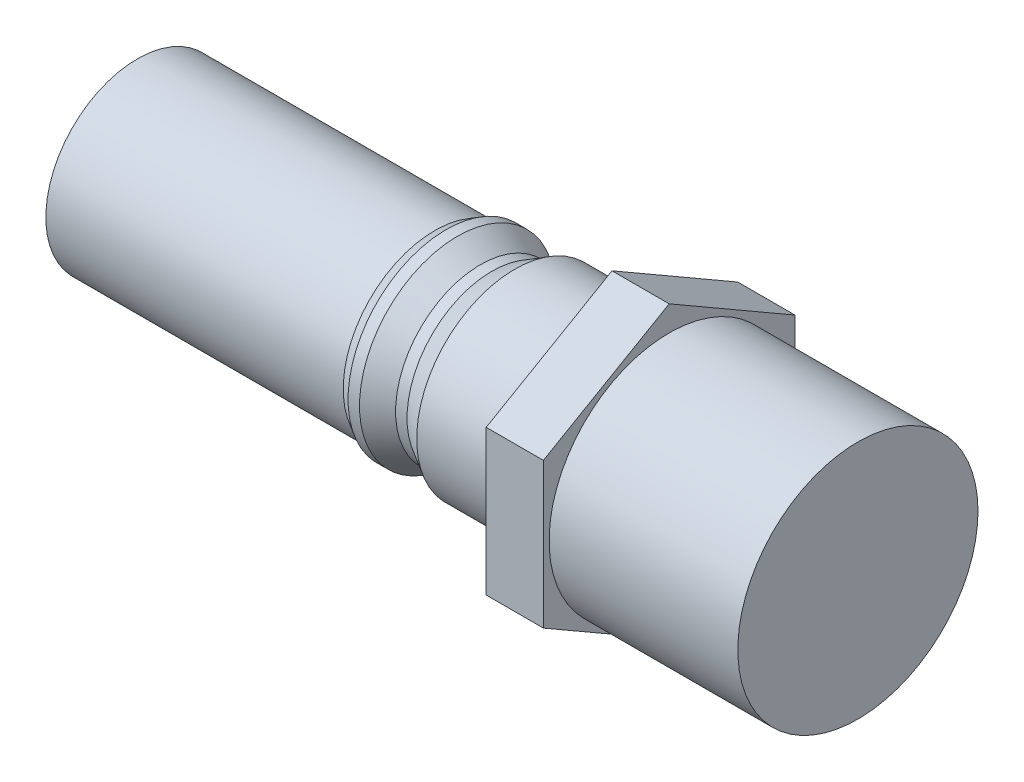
ISO-10303-21;
HEADER;
FILE_DESCRIPTION(('STEP AP214'),'2;1');
FILE_NAME('part.step','',(''),(''),'','','');
FILE_SCHEMA(('AUTOMOTIVE_DESIGN { 1 0 10303 214 1 1 1 1 }'));
ENDSEC;
DATA;
#1=APPLICATION_CONTEXT('core data for automotive mechanical design processes');
#2=APPLICATION_PROTOCOL_DEFINITION('international standard','automotive_design',2000,#1);
#3=PRODUCT_CONTEXT('',#1,'mechanical');
#4=PRODUCT('Part','Part','',(#3));
#5=PRODUCT_RELATED_PRODUCT_CATEGORY('part','',(#4));
#6=PRODUCT_DEFINITION_FORMATION('','',#4);
#7=PRODUCT_DEFINITION_CONTEXT('part definition',#1,'design');
#8=PRODUCT_DEFINITION('design','',#6,#7);
#9=PRODUCT_DEFINITION_SHAPE('','',#8);
#10=(LENGTH_UNIT() NAMED_UNIT(*) SI_UNIT(.MILLI.,.METRE.));
#11=(NAMED_UNIT(*) PLANE_ANGLE_UNIT() SI_UNIT($,.RADIAN.));
#12=(NAMED_UNIT(*) SI_UNIT($,.STERADIAN.) SOLID_ANGLE_UNIT());
#13=UNCERTAINTY_MEASURE_WITH_UNIT(LENGTH_MEASURE(1.E-05),#10,'distance_accuracy_value','');
#14=(GEOMETRIC_REPRESENTATION_CONTEXT(3) GLOBAL_UNCERTAINTY_ASSIGNED_CONTEXT((#13)) GLOBAL_UNIT_ASSIGNED_CONTEXT((#10,
#11,#12)) REPRESENTATION_CONTEXT('',''));
#15=CARTESIAN_POINT('',(0.,0.,0.));
#16=DIRECTION('',(0.,0.,1.));
#17=DIRECTION('',(1.,0.,0.));
#18=AXIS2_PLACEMENT_3D('',#15,#16,#17);
#19=CARTESIAN_POINT('',(0.,0.,0.));
#20=DIRECTION('',(-1.,0.,0.));
#21=DIRECTION('',(0.,0.,1.));
#22=AXIS2_PLACEMENT_3D('',#19,#20,#21);
#23=PLANE('',#22);
#24=CARTESIAN_POINT('',(0.,0.,0.));
#25=DIRECTION('',(1.,0.,0.));
#26=DIRECTION('',(0.,0.,-1.));
#27=AXIS2_PLACEMENT_3D('',#24,#25,#26);
#28=CIRCLE('',#27,8.);
#29=CARTESIAN_POINT('',(0.,0.,-8.));
#30=VERTEX_POINT('',#29);
#31=EDGE_CURVE('E36',#30,#30,#28,.T.);
#32=ORIENTED_EDGE('',*,*,#31,.F.);
#33=EDGE_LOOP('',(#32));
#34=FACE_BOUND('',#33,.T.);
#35=ADVANCED_FACE('F33',(#34),#23,.T.);
#36=CARTESIAN_POINT('',(41.5,0.,0.));
#37=DIRECTION('',(1.,0.,0.));
#38=DIRECTION('',(0.,0.,-1.));
#39=AXIS2_PLACEMENT_3D('',#36,#37,#38);
#40=CYLINDRICAL_SURFACE('',#39,8.);
#41=ORIENTED_EDGE('',*,*,#31,.T.);
#42=EDGE_LOOP('',(#41));
#43=FACE_BOUND('',#42,.T.);
#44=CARTESIAN_POINT('',(26.,0.,0.));
#45=DIRECTION('',(1.,0.,0.));
#46=DIRECTION('',(0.,0.,-1.));
#47=AXIS2_PLACEMENT_3D('',#44,#45,#46);
#48=CIRCLE('',#47,8.);
#49=CARTESIAN_POINT('',(26.,0.,-8.));
#50=VERTEX_POINT('',#49);
#51=EDGE_CURVE('E156',#50,#50,#48,.T.);
#52=ORIENTED_EDGE('',*,*,#51,.F.);
#53=EDGE_LOOP('',(#52));
#54=FACE_BOUND('',#53,.T.);
#55=ADVANCED_FACE('F163',(#43,#54),#40,.T.);
#56=CARTESIAN_POINT('',(27.,0.,0.));
#57=DIRECTION('',(1.,0.,0.));
#58=DIRECTION('',(0.,0.,-1.));
#59=AXIS2_PLACEMENT_3D('',#56,#57,#58);
#60=CONICAL_SURFACE('',#59,8.57735026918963,0.5235987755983);
#61=ORIENTED_EDGE('',*,*,#51,.T.);
#62=EDGE_LOOP('',(#61));
#63=FACE_BOUND('',#62,.T.);
#64=CARTESIAN_POINT('',(27.,0.,0.));
#65=DIRECTION('',(1.,0.,0.));
#66=DIRECTION('',(0.,0.,-1.));
#67=AXIS2_PLACEMENT_3D('',#64,#65,#66);
#68=CIRCLE('',#67,8.57735026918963);
#69=CARTESIAN_POINT('',(27.,0.,-8.57735026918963));
#70=VERTEX_POINT('',#69);
#71=EDGE_CURVE('E154',#70,#70,#68,.T.);
#72=ORIENTED_EDGE('',*,*,#71,.F.);
#73=EDGE_LOOP('',(#72));
#74=FACE_BOUND('',#73,.T.);
#75=ADVANCED_FACE('F170',(#63,#74),#60,.T.);
#76=CARTESIAN_POINT('',(41.5,0.,0.));
#77=DIRECTION('',(1.,0.,0.));
#78=DIRECTION('',(0.,0.,-1.));
#79=AXIS2_PLACEMENT_3D('',#76,#77,#78);
#80=CYLINDRICAL_SURFACE('',#79,8.57735026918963);
#81=ORIENTED_EDGE('',*,*,#71,.T.);
#82=EDGE_LOOP('',(#81));
#83=FACE_BOUND('',#82,.T.);
#84=CARTESIAN_POINT('',(28.,0.,0.));
#85=DIRECTION('',(1.,0.,0.));
#86=DIRECTION('',(0.,0.,-1.));
#87=AXIS2_PLACEMENT_3D('',#84,#85,#86);
#88=CIRCLE('',#87,8.57735026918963);
#89=CARTESIAN_POINT('',(28.,0.,-8.57735026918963));
#90=VERTEX_POINT('',#89);
#91=EDGE_CURVE('E151',#90,#90,#88,.T.);
#92=ORIENTED_EDGE('',*,*,#91,.F.);
#93=EDGE_LOOP('',(#92));
#94=FACE_BOUND('',#93,.T.);
#95=ADVANCED_FACE('F174',(#83,#94),#80,.T.);
#96=CARTESIAN_POINT('',(30.,0.,0.));
#97=DIRECTION('',(-1.,0.,0.));
#98=DIRECTION('',(0.,0.,1.));
#99=AXIS2_PLACEMENT_3D('',#96,#97,#98);
#100=CONICAL_SURFACE('',#99,7.42264973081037,0.5235987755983);
#101=ORIENTED_EDGE('',*,*,#91,.T.);
#102=EDGE_LOOP('',(#101));
#103=FACE_BOUND('',#102,.T.);
#104=CARTESIAN_POINT('',(30.,0.,0.));
#105=DIRECTION('',(1.,0.,0.));
#106=DIRECTION('',(0.,0.,-1.));
#107=AXIS2_PLACEMENT_3D('',#104,#105,#106);
#108=CIRCLE('',#107,7.42264973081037);
#109=CARTESIAN_POINT('',(30.,0.,-7.42264973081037));
#110=VERTEX_POINT('',#109);
#111=EDGE_CURVE('E148',#110,#110,#108,.T.);
#112=ORIENTED_EDGE('',*,*,#111,.F.);
#113=EDGE_LOOP('',(#112));
#114=FACE_BOUND('',#113,.T.);
#115=ADVANCED_FACE('F179',(#103,#114),#100,.T.);
#116=CARTESIAN_POINT('',(41.5,0.,0.));
#117=DIRECTION('',(1.,0.,0.));
#118=DIRECTION('',(0.,0.,-1.));
#119=AXIS2_PLACEMENT_3D('',#116,#117,#118);
#120=CYLINDRICAL_SURFACE('',#119,7.42264973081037);
#121=ORIENTED_EDGE('',*,*,#111,.T.);
#122=EDGE_LOOP('',(#121));
#123=FACE_BOUND('',#122,.T.);
#124=CARTESIAN_POINT('',(31.,0.,0.));
#125=DIRECTION('',(1.,0.,0.));
#126=DIRECTION('',(0.,0.,-1.));
#127=AXIS2_PLACEMENT_3D('',#124,#125,#126);
#128=CIRCLE('',#127,7.42264973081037);
#129=CARTESIAN_POINT('',(31.,0.,-7.42264973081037));
#130=VERTEX_POINT('',#129);
#131=EDGE_CURVE('E145',#130,#130,#128,.T.);
#132=ORIENTED_EDGE('',*,*,#131,.F.);
#133=EDGE_LOOP('',(#132));
#134=FACE_BOUND('',#133,.T.);
#135=ADVANCED_FACE('F183',(#123,#134),#120,.T.);
#136=CARTESIAN_POINT('',(33.,0.,0.));
#137=DIRECTION('',(1.,0.,0.));
#138=DIRECTION('',(0.,0.,-1.));
#139=AXIS2_PLACEMENT_3D('',#136,#137,#138);
#140=CONICAL_SURFACE('',#139,8.57735026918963,0.5235987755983);
#141=ORIENTED_EDGE('',*,*,#131,.T.);
#142=EDGE_LOOP('',(#141));
#143=FACE_BOUND('',#142,.T.);
#144=CARTESIAN_POINT('',(33.,0.,0.));
#145=DIRECTION('',(1.,0.,0.));
#146=DIRECTION('',(0.,0.,-1.));
#147=AXIS2_PLACEMENT_3D('',#144,#145,#146);
#148=CIRCLE('',#147,8.57735026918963);
#149=CARTESIAN_POINT('',(33.,0.,-8.57735026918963));
#150=VERTEX_POINT('',#149);
#151=EDGE_CURVE('E142',#150,#150,#148,.T.);
#152=ORIENTED_EDGE('',*,*,#151,.F.);
#153=EDGE_LOOP('',(#152));
#154=FACE_BOUND('',#153,.T.);
#155=ADVANCED_FACE('F187',(#143,#154),#140,.T.);
#156=CARTESIAN_POINT('',(41.5,0.,0.));
#157=DIRECTION('',(1.,0.,0.));
#158=DIRECTION('',(0.,0.,-1.));
#159=AXIS2_PLACEMENT_3D('',#156,#157,#158);
#160=CYLINDRICAL_SURFACE('',#159,8.57735026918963);
#161=ORIENTED_EDGE('',*,*,#151,.T.);
#162=EDGE_LOOP('',(#161));
#163=FACE_BOUND('',#162,.T.);
#164=CARTESIAN_POINT('',(41.5,0.,0.));
#165=DIRECTION('',(1.,0.,0.));
#166=DIRECTION('',(0.,0.,-1.));
#167=AXIS2_PLACEMENT_3D('',#164,#165,#166);
#168=CIRCLE('',#167,8.57735026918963);
#169=CARTESIAN_POINT('',(41.5,0.,-8.57735026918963));
#170=VERTEX_POINT('',#169);
#171=EDGE_CURVE('E139',#170,#170,#168,.T.);
#172=ORIENTED_EDGE('',*,*,#171,.F.);
#173=EDGE_LOOP('',(#172));
#174=FACE_BOUND('',#173,.T.);
#175=ADVANCED_FACE('F191',(#163,#174),#160,.T.);
#176=CARTESIAN_POINT('',(46.5,6.35085296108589,-11.));
#177=DIRECTION('',(0.,-0.866025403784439,0.5));
#178=DIRECTION('',(0.,-0.5,-0.866025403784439));
#179=AXIS2_PLACEMENT_3D('',#176,#177,#178);
#180=PLANE('',#179);
#181=DIRECTION('',(0.,0.5,0.866025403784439));
#182=VECTOR('',#181,1.);
#183=CARTESIAN_POINT('',(41.5,6.35085296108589,-11.));
#184=LINE('',#183,#182);
#185=CARTESIAN_POINT('',(41.5,6.35085296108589,-11.));
#186=VERTEX_POINT('',#185);
#187=CARTESIAN_POINT('',(41.5,12.7017059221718,0.));
#188=VERTEX_POINT('',#187);
#189=EDGE_CURVE('E119',#186,#188,#184,.T.);
#190=ORIENTED_EDGE('',*,*,#189,.T.);
#191=DIRECTION('',(-1.,0.,0.));
#192=VECTOR('',#191,1.);
#193=CARTESIAN_POINT('',(46.5,12.7017059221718,0.));
#194=LINE('',#193,#192);
#195=CARTESIAN_POINT('',(46.5,12.7017059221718,0.));
#196=VERTEX_POINT('',#195);
#197=EDGE_CURVE('E137',#196,#188,#194,.T.);
#198=ORIENTED_EDGE('',*,*,#197,.F.);
#199=DIRECTION('',(0.,0.5,0.866025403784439));
#200=VECTOR('',#199,1.);
#201=CARTESIAN_POINT('',(46.5,6.35085296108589,-11.));
#202=LINE('',#201,#200);
#203=CARTESIAN_POINT('',(46.5,6.35085296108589,-11.));
#204=VERTEX_POINT('',#203);
#205=EDGE_CURVE('E130',#204,#196,#202,.T.);
#206=ORIENTED_EDGE('',*,*,#205,.F.);
#207=DIRECTION('',(-1.,0.,0.));
#208=VECTOR('',#207,1.);
#209=CARTESIAN_POINT('',(46.5,6.35085296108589,-11.));
#210=LINE('',#209,#208);
#211=EDGE_CURVE('E115',#204,#186,#210,.T.);
#212=ORIENTED_EDGE('',*,*,#211,.T.);
#213=EDGE_LOOP('',(#190,#198,#206,#212));
#214=FACE_BOUND('',#213,.T.);
#215=ADVANCED_FACE('F195',(#214),#180,.F.);
#216=CARTESIAN_POINT('',(46.5,12.7017059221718,0.));
#217=DIRECTION('',(0.,-0.866025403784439,-0.5));
#218=DIRECTION('',(0.,0.5,-0.866025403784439));
#219=AXIS2_PLACEMENT_3D('',#216,#217,#218);
#220=PLANE('',#219);
#221=DIRECTION('',(0.,-0.5,0.866025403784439));
#222=VECTOR('',#221,1.);
#223=CARTESIAN_POINT('',(41.5,12.7017059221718,0.));
#224=LINE('',#223,#222);
#225=CARTESIAN_POINT('',(41.5,6.35085296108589,11.));
#226=VERTEX_POINT('',#225);
#227=EDGE_CURVE('E122',#188,#226,#224,.T.);
#228=ORIENTED_EDGE('',*,*,#227,.T.);
#229=DIRECTION('',(-1.,0.,0.));
#230=VECTOR('',#229,1.);
#231=CARTESIAN_POINT('',(46.5,6.35085296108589,11.));
#232=LINE('',#231,#230);
#233=CARTESIAN_POINT('',(46.5,6.35085296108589,11.));
#234=VERTEX_POINT('',#233);
#235=EDGE_CURVE('E134',#234,#226,#232,.T.);
#236=ORIENTED_EDGE('',*,*,#235,.F.);
#237=DIRECTION('',(0.,-0.5,0.866025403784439));
#238=VECTOR('',#237,1.);
#239=CARTESIAN_POINT('',(46.5,12.7017059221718,0.));
#240=LINE('',#239,#238);
#241=EDGE_CURVE('E88',#196,#234,#240,.T.);
#242=ORIENTED_EDGE('',*,*,#241,.F.);
#243=ORIENTED_EDGE('',*,*,#197,.T.);
#244=EDGE_LOOP('',(#228,#236,#242,#243));
#245=FACE_BOUND('',#244,.T.);
#246=ADVANCED_FACE('F199',(#245),#220,.F.);
#247=CARTESIAN_POINT('',(46.5,6.35085296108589,11.));
#248=DIRECTION('',(0.,0.,-1.));
#249=DIRECTION('',(-1.,0.,0.));
#250=AXIS2_PLACEMENT_3D('',#247,#248,#249);
#251=PLANE('',#250);
#252=DIRECTION('',(0.,-1.,0.));
#253=VECTOR('',#252,1.);
#254=CARTESIAN_POINT('',(41.5,6.35085296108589,11.));
#255=LINE('',#254,#253);
#256=CARTESIAN_POINT('',(41.5,-6.35085296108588,11.));
#257=VERTEX_POINT('',#256);
#258=EDGE_CURVE('E125',#226,#257,#255,.T.);
#259=ORIENTED_EDGE('',*,*,#258,.T.);
#260=DIRECTION('',(-1.,0.,0.));
#261=VECTOR('',#260,1.);
#262=CARTESIAN_POINT('',(46.5,-6.35085296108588,11.));
#263=LINE('',#262,#261);
#264=CARTESIAN_POINT('',(46.5,-6.35085296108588,11.));
#265=VERTEX_POINT('',#264);
#266=EDGE_CURVE('E110',#265,#257,#263,.T.);
#267=ORIENTED_EDGE('',*,*,#266,.F.);
#268=DIRECTION('',(0.,-1.,0.));
#269=VECTOR('',#268,1.);
#270=CARTESIAN_POINT('',(46.5,6.35085296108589,11.));
#271=LINE('',#270,#269);
#272=EDGE_CURVE('E101',#234,#265,#271,.T.);
#273=ORIENTED_EDGE('',*,*,#272,.F.);
#274=ORIENTED_EDGE('',*,*,#235,.T.);
#275=EDGE_LOOP('',(#259,#267,#273,#274));
#276=FACE_BOUND('',#275,.T.);
#277=ADVANCED_FACE('F203',(#276),#251,.F.);
#278=CARTESIAN_POINT('',(46.5,-6.35085296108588,11.));
#279=DIRECTION('',(0.,0.866025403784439,-0.5));
#280=DIRECTION('',(0.,0.5,0.866025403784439));
#281=AXIS2_PLACEMENT_3D('',#278,#279,#280);
#282=PLANE('',#281);
#283=DIRECTION('',(0.,-0.5,-0.866025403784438));
#284=VECTOR('',#283,1.);
#285=CARTESIAN_POINT('',(41.5,-6.35085296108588,11.));
#286=LINE('',#285,#284);
#287=CARTESIAN_POINT('',(41.5,-12.7017059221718,0.));
#288=VERTEX_POINT('',#287);
#289=EDGE_CURVE('E109',#257,#288,#286,.T.);
#290=ORIENTED_EDGE('',*,*,#289,.T.);
#291=DIRECTION('',(-1.,0.,0.));
#292=VECTOR('',#291,1.);
#293=CARTESIAN_POINT('',(46.5,-12.7017059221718,0.));
#294=LINE('',#293,#292);
#295=CARTESIAN_POINT('',(46.5,-12.7017059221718,0.));
#296=VERTEX_POINT('',#295);
#297=EDGE_CURVE('E106',#296,#288,#294,.T.);
#298=ORIENTED_EDGE('',*,*,#297,.F.);
#299=DIRECTION('',(0.,-0.5,-0.866025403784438));
#300=VECTOR('',#299,1.);
#301=CARTESIAN_POINT('',(46.5,-6.35085296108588,11.));
#302=LINE('',#301,#300);
#303=EDGE_CURVE('E95',#265,#296,#302,.T.);
#304=ORIENTED_EDGE('',*,*,#303,.F.);
#305=ORIENTED_EDGE('',*,*,#266,.T.);
#306=EDGE_LOOP('',(#290,#298,#304,#305));
#307=FACE_BOUND('',#306,.T.);
#308=ADVANCED_FACE('F107',(#307),#282,.F.);
#309=CARTESIAN_POINT('',(46.5,-12.7017059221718,0.));
#310=DIRECTION('',(0.,0.866025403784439,0.5));
#311=DIRECTION('',(0.,-0.5,0.866025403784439));
#312=AXIS2_PLACEMENT_3D('',#309,#310,#311);
#313=PLANE('',#312);
#314=DIRECTION('',(0.,0.5,-0.866025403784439));
#315=VECTOR('',#314,1.);
#316=CARTESIAN_POINT('',(41.5,-12.7017059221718,0.));
#317=LINE('',#316,#315);
#318=CARTESIAN_POINT('',(41.5,-6.35085296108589,-11.));
#319=VERTEX_POINT('',#318);
#320=EDGE_CURVE('E73',#288,#319,#317,.T.);
#321=ORIENTED_EDGE('',*,*,#320,.T.);
#322=DIRECTION('',(-1.,0.,0.));
#323=VECTOR('',#322,1.);
#324=CARTESIAN_POINT('',(46.5,-6.35085296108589,-11.));
#325=LINE('',#324,#323);
#326=CARTESIAN_POINT('',(46.5,-6.35085296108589,-11.));
#327=VERTEX_POINT('',#326);
#328=EDGE_CURVE('E111',#327,#319,#325,.T.);
#329=ORIENTED_EDGE('',*,*,#328,.F.);
#330=DIRECTION('',(0.,0.5,-0.866025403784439));
#331=VECTOR('',#330,1.);
#332=CARTESIAN_POINT('',(46.5,-12.7017059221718,0.));
#333=LINE('',#332,#331);
#334=EDGE_CURVE('E99',#296,#327,#333,.T.);
#335=ORIENTED_EDGE('',*,*,#334,.F.);
#336=ORIENTED_EDGE('',*,*,#297,.T.);
#337=EDGE_LOOP('',(#321,#329,#335,#336));
#338=FACE_BOUND('',#337,.T.);
#339=ADVANCED_FACE('F113',(#338),#313,.F.);
#340=CARTESIAN_POINT('',(46.5,-6.35085296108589,-11.));
#341=DIRECTION('',(0.,0.,1.));
#342=DIRECTION('',(1.,0.,0.));
#343=AXIS2_PLACEMENT_3D('',#340,#341,#342);
#344=PLANE('',#343);
#345=DIRECTION('',(0.,1.,0.));
#346=VECTOR('',#345,1.);
#347=CARTESIAN_POINT('',(41.5,-6.35085296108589,-11.));
#348=LINE('',#347,#346);
#349=EDGE_CURVE('E79',#319,#186,#348,.T.);
#350=ORIENTED_EDGE('',*,*,#349,.T.);
#351=ORIENTED_EDGE('',*,*,#211,.F.);
#352=DIRECTION('',(0.,1.,0.));
#353=VECTOR('',#352,1.);
#354=CARTESIAN_POINT('',(46.5,-6.35085296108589,-11.));
#355=LINE('',#354,#353);
#356=EDGE_CURVE('E50',#327,#204,#355,.T.);
#357=ORIENTED_EDGE('',*,*,#356,.F.);
#358=ORIENTED_EDGE('',*,*,#328,.T.);
#359=EDGE_LOOP('',(#350,#351,#357,#358));
#360=FACE_BOUND('',#359,.T.);
#361=ADVANCED_FACE('F211',(#360),#344,.F.);
#362=CARTESIAN_POINT('',(46.5,0.,0.));
#363=DIRECTION('',(1.,0.,0.));
#364=DIRECTION('',(0.,0.,-1.));
#365=AXIS2_PLACEMENT_3D('',#362,#363,#364);
#366=PLANE('',#365);
#367=CARTESIAN_POINT('',(46.5,0.,0.));
#368=DIRECTION('',(1.,0.,0.));
#369=DIRECTION('',(0.,0.,-1.));
#370=AXIS2_PLACEMENT_3D('',#367,#368,#369);
#371=CIRCLE('',#370,10.5);
#372=CARTESIAN_POINT('',(46.5,0.,-10.5));
#373=VERTEX_POINT('',#372);
#374=EDGE_CURVE('E11',#373,#373,#371,.T.);
#375=ORIENTED_EDGE('',*,*,#374,.F.);
#376=EDGE_LOOP('',(#375));
#377=FACE_BOUND('',#376,.T.);
#378=ORIENTED_EDGE('',*,*,#205,.T.);
#379=ORIENTED_EDGE('',*,*,#241,.T.);
#380=ORIENTED_EDGE('',*,*,#272,.T.);
#381=ORIENTED_EDGE('',*,*,#303,.T.);
#382=ORIENTED_EDGE('',*,*,#334,.T.);
#383=ORIENTED_EDGE('',*,*,#356,.T.);
#384=EDGE_LOOP('',(#378,#379,#380,#381,#382,#383));
#385=FACE_BOUND('',#384,.T.);
#386=ADVANCED_FACE('F97',(#377,#385),#366,.T.);
#387=CARTESIAN_POINT('',(41.5,0.,0.));
#388=DIRECTION('',(1.,0.,0.));
#389=DIRECTION('',(0.,0.,-1.));
#390=AXIS2_PLACEMENT_3D('',#387,#388,#389);
#391=PLANE('',#390);
#392=ORIENTED_EDGE('',*,*,#171,.T.);
#393=EDGE_LOOP('',(#392));
#394=FACE_BOUND('',#393,.T.);
#395=ORIENTED_EDGE('',*,*,#189,.F.);
#396=ORIENTED_EDGE('',*,*,#349,.F.);
#397=ORIENTED_EDGE('',*,*,#320,.F.);
#398=ORIENTED_EDGE('',*,*,#289,.F.);
#399=ORIENTED_EDGE('',*,*,#258,.F.);
#400=ORIENTED_EDGE('',*,*,#227,.F.);
#401=EDGE_LOOP('',(#395,#396,#397,#398,#399,#400));
#402=FACE_BOUND('',#401,.T.);
#403=ADVANCED_FACE('F214',(#394,#402),#391,.F.);
#404=CARTESIAN_POINT('',(63.,0.,0.));
#405=DIRECTION('',(-1.,0.,0.));
#406=DIRECTION('',(0.,0.,1.));
#407=AXIS2_PLACEMENT_3D('',#404,#405,#406);
#408=CYLINDRICAL_SURFACE('',#407,10.5);
#409=CARTESIAN_POINT('',(63.,0.,0.));
#410=DIRECTION('',(1.,0.,0.));
#411=DIRECTION('',(0.,0.,-1.));
#412=AXIS2_PLACEMENT_3D('',#409,#410,#411);
#413=CIRCLE('',#412,10.5);
#414=CARTESIAN_POINT('',(63.,0.,-10.5));
#415=VERTEX_POINT('',#414);
#416=EDGE_CURVE('E123',#415,#415,#413,.T.);
#417=ORIENTED_EDGE('',*,*,#416,.F.);
#418=EDGE_LOOP('',(#417));
#419=FACE_BOUND('',#418,.T.);
#420=ORIENTED_EDGE('',*,*,#374,.T.);
#421=EDGE_LOOP('',(#420));
#422=FACE_BOUND('',#421,.T.);
#423=ADVANCED_FACE('F217',(#419,#422),#408,.T.);
#424=CARTESIAN_POINT('',(63.,0.,0.));
#425=DIRECTION('',(1.,0.,0.));
#426=DIRECTION('',(0.,0.,-1.));
#427=AXIS2_PLACEMENT_3D('',#424,#425,#426);
#428=PLANE('',#427);
#429=ORIENTED_EDGE('',*,*,#416,.T.);
#430=EDGE_LOOP('',(#429));
#431=FACE_BOUND('',#430,.T.);
#432=ADVANCED_FACE('F224',(#431),#428,.T.);
#433=CLOSED_SHELL('',(#35,#55,#75,#95,#115,#135,#155,#175,#215,#246,#277,#308,#339,#361,#386,
#403,#423,#432));
#434=MANIFOLD_SOLID_BREP('B2',#433);
#435=ADVANCED_BREP_SHAPE_REPRESENTATION('',(#18,#434),#14);
#436=SHAPE_DEFINITION_REPRESENTATION(#9,#435);
ENDSEC;
END-ISO-10303-21;
